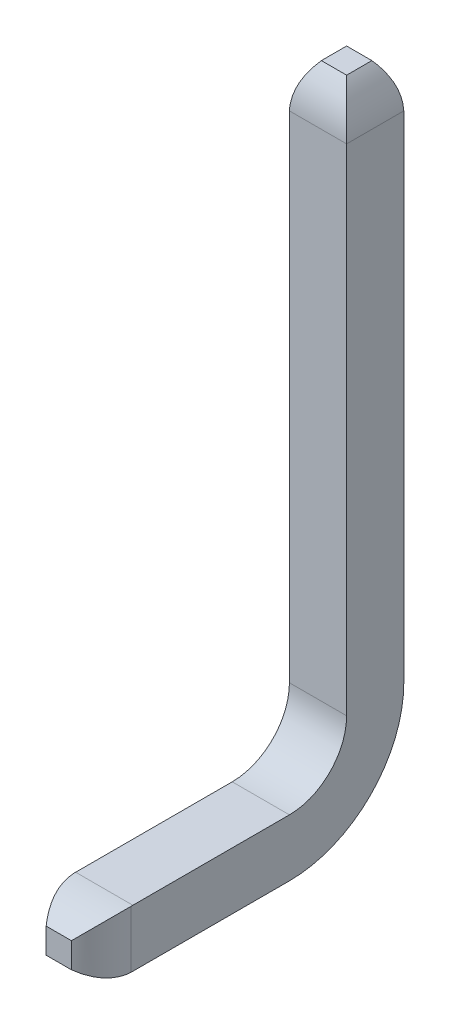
ISO-10303-21;
HEADER;
FILE_DESCRIPTION(('STEP AP214'),'2;1');
FILE_NAME('part.step','',(''),(''),'','','');
FILE_SCHEMA(('AUTOMOTIVE_DESIGN { 1 0 10303 214 1 1 1 1 }'));
ENDSEC;
DATA;
#1=APPLICATION_CONTEXT('core data for automotive mechanical design processes');
#2=APPLICATION_PROTOCOL_DEFINITION('international standard','automotive_design',2000,#1);
#3=PRODUCT_CONTEXT('',#1,'mechanical');
#4=PRODUCT('Part','Part','',(#3));
#5=PRODUCT_RELATED_PRODUCT_CATEGORY('part','',(#4));
#6=PRODUCT_DEFINITION_FORMATION('','',#4);
#7=PRODUCT_DEFINITION_CONTEXT('part definition',#1,'design');
#8=PRODUCT_DEFINITION('design','',#6,#7);
#9=PRODUCT_DEFINITION_SHAPE('','',#8);
#10=(LENGTH_UNIT() NAMED_UNIT(*) SI_UNIT(.MILLI.,.METRE.));
#11=(NAMED_UNIT(*) PLANE_ANGLE_UNIT() SI_UNIT($,.RADIAN.));
#12=(NAMED_UNIT(*) SI_UNIT($,.STERADIAN.) SOLID_ANGLE_UNIT());
#13=UNCERTAINTY_MEASURE_WITH_UNIT(LENGTH_MEASURE(1.E-05),#10,'distance_accuracy_value','');
#14=(GEOMETRIC_REPRESENTATION_CONTEXT(3) GLOBAL_UNCERTAINTY_ASSIGNED_CONTEXT((#13)) GLOBAL_UNIT_ASSIGNED_CONTEXT((#10,
#11,#12)) REPRESENTATION_CONTEXT('',''));
#15=CARTESIAN_POINT('',(0.,0.,0.));
#16=DIRECTION('',(0.,0.,1.));
#17=DIRECTION('',(1.,0.,0.));
#18=AXIS2_PLACEMENT_3D('',#15,#16,#17);
#19=CARTESIAN_POINT('',(0.384591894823,0.398742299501,2.12029800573));
#20=DIRECTION('',(0.,-1.,0.));
#21=DIRECTION('',(0.,0.,-1.));
#22=AXIS2_PLACEMENT_3D('',#19,#20,#21);
#23=CYLINDRICAL_SURFACE('',#22,0.635);
#24=CARTESIAN_POINT('',(-0.250190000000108,0.398531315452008,2.136939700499));
#25=CARTESIAN_POINT('',(-0.249812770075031,0.398160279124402,2.15140412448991));
#26=CARTESIAN_POINT('',(-0.248937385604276,0.397291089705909,2.16583284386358));
#27=CARTESIAN_POINT('',(-0.246222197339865,0.394588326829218,2.19449552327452));
#28=CARTESIAN_POINT('',(-0.244383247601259,0.392755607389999,2.20872964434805));
#29=CARTESIAN_POINT('',(-0.237513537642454,0.385904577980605,2.25070603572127));
#30=CARTESIAN_POINT('',(-0.231120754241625,0.379524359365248,2.27802199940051));
#31=CARTESIAN_POINT('',(-0.215201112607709,0.363630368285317,2.3306038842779));
#32=CARTESIAN_POINT('',(-0.205684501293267,0.354126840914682,2.35587617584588));
#33=CARTESIAN_POINT('',(-0.184043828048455,0.332513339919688,2.40416445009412));
#34=CARTESIAN_POINT('',(-0.171912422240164,0.320396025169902,2.4271738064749));
#35=CARTESIAN_POINT('',(-0.151298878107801,0.299805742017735,2.46125931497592));
#36=CARTESIAN_POINT('',(-0.143507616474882,0.29202314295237,2.47319261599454));
#37=CARTESIAN_POINT('',(-0.127388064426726,0.275921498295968,2.49619328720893));
#38=CARTESIAN_POINT('',(-0.119062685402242,0.267605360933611,2.50726472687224));
#39=CARTESIAN_POINT('',(-0.110489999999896,0.259042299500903,2.51793970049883));
#40=B_SPLINE_CURVE_WITH_KNOTS('',3,(#24,#25,#26,#27,#28,#29,#30,#31,#32,#33,#34,#35,#36,#37,#38,
#39),.UNSPECIFIED.,.F.,.F.,(4,2,2,2,2,2,2,4),(0.,0.0433870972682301,0.0867358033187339,
0.172547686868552,0.258080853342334,0.343857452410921,0.392536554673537,0.44096977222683),.UNSPECIFIED.);
#41=CARTESIAN_POINT('',(-0.250190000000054,0.398531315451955,2.13693970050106));
#42=VERTEX_POINT('',#41);
#43=CARTESIAN_POINT('',(-0.110489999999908,0.25904229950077,2.51793970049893));
#44=VERTEX_POINT('',#43);
#45=EDGE_CURVE('E122',#42,#44,#40,.T.);
#46=ORIENTED_EDGE('',*,*,#45,.F.);
#47=DIRECTION('',(0.,-1.,0.));
#48=VECTOR('',#47,1.);
#49=CARTESIAN_POINT('',(-0.250190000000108,0.398742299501,2.136939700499));
#50=LINE('',#49,#48);
#51=CARTESIAN_POINT('',(-0.250190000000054,-0.101426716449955,2.13693970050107));
#52=VERTEX_POINT('',#51);
#53=EDGE_CURVE('E125',#42,#52,#50,.T.);
#54=ORIENTED_EDGE('',*,*,#53,.T.);
#55=CARTESIAN_POINT('',(-0.110489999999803,0.038062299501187,2.51793970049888));
#56=CARTESIAN_POINT('',(-0.127635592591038,0.0209359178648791,2.49660889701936));
#57=CARTESIAN_POINT('',(-0.143837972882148,0.00475133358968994,2.47359119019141));
#58=CARTESIAN_POINT('',(-0.17378911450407,-0.0251659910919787,2.42407573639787));
#59=CARTESIAN_POINT('',(-0.187504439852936,-0.0388653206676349,2.39753784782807));
#60=CARTESIAN_POINT('',(-0.211535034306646,-0.0628649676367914,2.34120919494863));
#61=CARTESIAN_POINT('',(-0.221823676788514,-0.0731386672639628,2.31139524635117));
#62=CARTESIAN_POINT('',(-0.237911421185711,-0.0891972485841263,2.24960444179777));
#63=CARTESIAN_POINT('',(-0.243743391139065,-0.0950149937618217,2.21764534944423));
#64=CARTESIAN_POINT('',(-0.247902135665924,-0.099156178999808,2.17723767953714));
#65=CARTESIAN_POINT('',(-0.248573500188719,-0.0998240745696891,2.16920760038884));
#66=CARTESIAN_POINT('',(-0.249611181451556,-0.100854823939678,2.15310228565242));
#67=CARTESIAN_POINT('',(-0.24997727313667,-0.101217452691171,2.14502702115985));
#68=CARTESIAN_POINT('',(-0.250190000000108,-0.101426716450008,2.136939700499));
#69=B_SPLINE_CURVE_WITH_KNOTS('',3,(#55,#56,#57,#58,#59,#60,#61,#62,#63,#64,#65,#66,#67,#68),
.UNSPECIFIED.,.F.,.F.,(4,2,2,2,2,2,4),(0.,0.0969606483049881,0.195141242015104,
0.294067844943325,0.392257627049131,0.416507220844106,0.440774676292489),.UNSPECIFIED.);
#70=CARTESIAN_POINT('',(-0.110489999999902,0.038062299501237,2.51793970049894));
#71=VERTEX_POINT('',#70);
#72=EDGE_CURVE('E218',#71,#52,#69,.T.);
#73=ORIENTED_EDGE('',*,*,#72,.F.);
#74=DIRECTION('',(0.,-1.,0.));
#75=VECTOR('',#74,1.);
#76=CARTESIAN_POINT('',(-0.11049,0.398742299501,2.517939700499));
#77=LINE('',#76,#75);
#78=EDGE_CURVE('E134',#44,#71,#77,.T.);
#79=ORIENTED_EDGE('',*,*,#78,.F.);
#80=EDGE_LOOP('',(#46,#54,#73,#79));
#81=FACE_BOUND('',#80,.T.);
#82=ADVANCED_FACE('F17',(#81),#23,.T.);
#83=CARTESIAN_POINT('',(0.25019,0.398742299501,2.517939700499));
#84=DIRECTION('',(0.,0.,1.));
#85=DIRECTION('',(0.,-1.,0.));
#86=AXIS2_PLACEMENT_3D('',#83,#84,#85);
#87=PLANE('',#86);
#88=DIRECTION('',(1.,0.,0.));
#89=VECTOR('',#88,1.);
#90=CARTESIAN_POINT('',(-0.25019,0.259042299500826,2.51793970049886));
#91=LINE('',#90,#89);
#92=CARTESIAN_POINT('',(0.110489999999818,0.259042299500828,2.51793970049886));
#93=VERTEX_POINT('',#92);
#94=EDGE_CURVE('E137',#44,#93,#91,.T.);
#95=ORIENTED_EDGE('',*,*,#94,.F.);
#96=ORIENTED_EDGE('',*,*,#78,.T.);
#97=DIRECTION('',(1.,0.,0.));
#98=VECTOR('',#97,1.);
#99=CARTESIAN_POINT('',(-0.25019,0.0380622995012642,2.51793970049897));
#100=LINE('',#99,#98);
#101=CARTESIAN_POINT('',(0.110489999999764,0.0380622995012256,2.51793970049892));
#102=VERTEX_POINT('',#101);
#103=EDGE_CURVE('E215',#102,#71,#100,.F.);
#104=ORIENTED_EDGE('',*,*,#103,.F.);
#105=DIRECTION('',(0.,-1.,0.));
#106=VECTOR('',#105,1.);
#107=CARTESIAN_POINT('',(0.11048999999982,0.398742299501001,2.51793970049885));
#108=LINE('',#107,#106);
#109=EDGE_CURVE('E170',#93,#102,#108,.T.);
#110=ORIENTED_EDGE('',*,*,#109,.F.);
#111=EDGE_LOOP('',(#95,#96,#104,#110));
#112=FACE_BOUND('',#111,.T.);
#113=ADVANCED_FACE('F324',(#112),#87,.T.);
#114=CARTESIAN_POINT('',(-0.25019,0.533362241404,2.120569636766));
#115=DIRECTION('',(1.,0.,0.));
#116=DIRECTION('',(0.,0.,-1.));
#117=AXIS2_PLACEMENT_3D('',#114,#115,#116);
#118=CYLINDRICAL_SURFACE('',#117,0.635);
#119=CARTESIAN_POINT('',(-0.25019,0.533362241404,2.120569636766));
#120=DIRECTION('',(1.,0.,0.));
#121=DIRECTION('',(0.,0.,-1.));
#122=AXIS2_PLACEMENT_3D('',#119,#120,#121);
#123=CIRCLE('',#122,0.635);
#124=CARTESIAN_POINT('',(-0.25019,-0.101637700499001,2.120569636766));
#125=VERTEX_POINT('',#124);
#126=EDGE_CURVE('E130',#52,#125,#123,.T.);
#127=ORIENTED_EDGE('',*,*,#126,.T.);
#128=DIRECTION('',(1.,0.,0.));
#129=VECTOR('',#128,1.);
#130=CARTESIAN_POINT('',(-0.25019,-0.101637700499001,2.120569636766));
#131=LINE('',#130,#129);
#132=CARTESIAN_POINT('',(0.250190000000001,-0.101637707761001,2.120569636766));
#133=VERTEX_POINT('',#132);
#134=EDGE_CURVE('E211',#133,#125,#131,.F.);
#135=ORIENTED_EDGE('',*,*,#134,.F.);
#136=CARTESIAN_POINT('',(0.250190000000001,0.533362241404,2.120569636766));
#137=DIRECTION('',(1.,0.,0.));
#138=DIRECTION('',(0.,0.,-1.));
#139=AXIS2_PLACEMENT_3D('',#136,#137,#138);
#140=CIRCLE('',#139,0.635);
#141=CARTESIAN_POINT('',(0.250190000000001,-0.101426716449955,2.13693970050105));
#142=VERTEX_POINT('',#141);
#143=EDGE_CURVE('E171',#142,#133,#140,.T.);
#144=ORIENTED_EDGE('',*,*,#143,.F.);
#145=CARTESIAN_POINT('',(0.110489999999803,0.0380622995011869,2.51793970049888));
#146=CARTESIAN_POINT('',(0.127635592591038,0.0209359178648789,2.49660889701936));
#147=CARTESIAN_POINT('',(0.143837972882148,0.00475133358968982,2.47359119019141));
#148=CARTESIAN_POINT('',(0.17378911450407,-0.0251659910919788,2.42407573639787));
#149=CARTESIAN_POINT('',(0.187504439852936,-0.038865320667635,2.39753784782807));
#150=CARTESIAN_POINT('',(0.211535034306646,-0.0628649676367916,2.34120919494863));
#151=CARTESIAN_POINT('',(0.221823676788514,-0.0731386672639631,2.31139524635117));
#152=CARTESIAN_POINT('',(0.237911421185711,-0.0891972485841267,2.24960444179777));
#153=CARTESIAN_POINT('',(0.243743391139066,-0.0950149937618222,2.21764534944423));
#154=CARTESIAN_POINT('',(0.247902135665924,-0.0991561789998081,2.17723767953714));
#155=CARTESIAN_POINT('',(0.24857350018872,-0.0998240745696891,2.16920760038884));
#156=CARTESIAN_POINT('',(0.249611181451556,-0.100854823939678,2.15310228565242));
#157=CARTESIAN_POINT('',(0.24997727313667,-0.101217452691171,2.14502702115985));
#158=CARTESIAN_POINT('',(0.250190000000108,-0.101426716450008,2.136939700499));
#159=B_SPLINE_CURVE_WITH_KNOTS('',3,(#145,#146,#147,#148,#149,#150,#151,#152,#153,#154,#155,
#156,#157,#158),.UNSPECIFIED.,.F.,.F.,(4,2,2,2,2,2,4),(0.,0.0969606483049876,0.195141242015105,
0.294067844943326,0.392257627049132,0.416507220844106,0.440774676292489),.UNSPECIFIED.);
#160=EDGE_CURVE('E139',#102,#142,#159,.T.);
#161=ORIENTED_EDGE('',*,*,#160,.F.);
#162=ORIENTED_EDGE('',*,*,#103,.T.);
#163=ORIENTED_EDGE('',*,*,#72,.T.);
#164=EDGE_LOOP('',(#127,#135,#144,#161,#162,#163));
#165=FACE_BOUND('',#164,.T.);
#166=ADVANCED_FACE('F316',(#165),#118,.T.);
#167=CARTESIAN_POINT('',(-0.25019,-0.101637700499,2.517939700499));
#168=DIRECTION('',(0.,-1.,0.));
#169=DIRECTION('',(0.,0.,-1.));
#170=AXIS2_PLACEMENT_3D('',#167,#168,#169);
#171=PLANE('',#170);
#172=DIRECTION('',(0.,0.,-1.));
#173=VECTOR('',#172,1.);
#174=CARTESIAN_POINT('',(-0.25019,-0.101637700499,2.517939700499));
#175=LINE('',#174,#173);
#176=CARTESIAN_POINT('',(-0.25019,-0.101637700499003,0.750570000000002));
#177=VERTEX_POINT('',#176);
#178=EDGE_CURVE('E207',#125,#177,#175,.T.);
#179=ORIENTED_EDGE('',*,*,#178,.T.);
#180=DIRECTION('',(1.,0.,0.));
#181=VECTOR('',#180,1.);
#182=CARTESIAN_POINT('',(-0.25019,-0.101637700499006,0.75057));
#183=LINE('',#182,#181);
#184=CARTESIAN_POINT('',(0.250190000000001,-0.101637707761,0.75057));
#185=VERTEX_POINT('',#184);
#186=EDGE_CURVE('E210',#177,#185,#183,.T.);
#187=ORIENTED_EDGE('',*,*,#186,.T.);
#188=DIRECTION('',(0.,0.,-1.));
#189=VECTOR('',#188,1.);
#190=CARTESIAN_POINT('',(0.25019,-0.101637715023,-5.142700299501));
#191=LINE('',#190,#189);
#192=EDGE_CURVE('E174',#133,#185,#191,.T.);
#193=ORIENTED_EDGE('',*,*,#192,.F.);
#194=ORIENTED_EDGE('',*,*,#134,.T.);
#195=EDGE_LOOP('',(#179,#187,#193,#194));
#196=FACE_BOUND('',#195,.T.);
#197=ADVANCED_FACE('F313',(#196),#171,.T.);
#198=CARTESIAN_POINT('',(-0.25019,0.398742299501,2.517939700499));
#199=DIRECTION('',(0.,-1.,0.));
#200=DIRECTION('',(0.,0.,-1.));
#201=AXIS2_PLACEMENT_3D('',#198,#199,#200);
#202=PLANE('',#201);
#203=DIRECTION('',(1.,0.,0.));
#204=VECTOR('',#203,1.);
#205=CARTESIAN_POINT('',(-0.25019,0.398742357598,2.120569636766));
#206=LINE('',#205,#204);
#207=CARTESIAN_POINT('',(0.250190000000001,0.3987423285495,2.120569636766));
#208=VERTEX_POINT('',#207);
#209=CARTESIAN_POINT('',(-0.25019,0.398742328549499,2.120569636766));
#210=VERTEX_POINT('',#209);
#211=EDGE_CURVE('E124',#208,#210,#206,.F.);
#212=ORIENTED_EDGE('',*,*,#211,.F.);
#213=DIRECTION('',(0.,0.,-1.));
#214=VECTOR('',#213,1.);
#215=CARTESIAN_POINT('',(0.25019,0.398742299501,-5.142700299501));
#216=LINE('',#215,#214);
#217=CARTESIAN_POINT('',(0.25019,0.398742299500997,0.75057));
#218=VERTEX_POINT('',#217);
#219=EDGE_CURVE('E179',#218,#208,#216,.F.);
#220=ORIENTED_EDGE('',*,*,#219,.F.);
#221=DIRECTION('',(1.,0.,0.));
#222=VECTOR('',#221,1.);
#223=CARTESIAN_POINT('',(-0.25019,0.398742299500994,0.75057));
#224=LINE('',#223,#222);
#225=CARTESIAN_POINT('',(-0.25019,0.398742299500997,0.750570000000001));
#226=VERTEX_POINT('',#225);
#227=EDGE_CURVE('E212',#226,#218,#224,.T.);
#228=ORIENTED_EDGE('',*,*,#227,.F.);
#229=DIRECTION('',(0.,0.,-1.));
#230=VECTOR('',#229,1.);
#231=CARTESIAN_POINT('',(-0.25019,0.398742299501,2.517939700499));
#232=LINE('',#231,#230);
#233=EDGE_CURVE('E141',#210,#226,#232,.T.);
#234=ORIENTED_EDGE('',*,*,#233,.F.);
#235=EDGE_LOOP('',(#212,#220,#228,#234));
#236=FACE_BOUND('',#235,.T.);
#237=ADVANCED_FACE('F159',(#236),#202,.F.);
#238=CARTESIAN_POINT('',(-0.25019,-0.236257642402,2.120569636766));
#239=DIRECTION('',(1.,0.,0.));
#240=DIRECTION('',(0.,0.,-1.));
#241=AXIS2_PLACEMENT_3D('',#238,#239,#240);
#242=CYLINDRICAL_SURFACE('',#241,0.635);
#243=CARTESIAN_POINT('',(0.250190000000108,0.398531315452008,2.136939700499));
#244=CARTESIAN_POINT('',(0.249812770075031,0.398160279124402,2.15140412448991));
#245=CARTESIAN_POINT('',(0.248937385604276,0.397291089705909,2.16583284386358));
#246=CARTESIAN_POINT('',(0.246222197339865,0.394588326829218,2.19449552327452));
#247=CARTESIAN_POINT('',(0.244383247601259,0.392755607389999,2.20872964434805));
#248=CARTESIAN_POINT('',(0.237513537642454,0.385904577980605,2.25070603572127));
#249=CARTESIAN_POINT('',(0.231120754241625,0.379524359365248,2.27802199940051));
#250=CARTESIAN_POINT('',(0.215201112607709,0.363630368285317,2.3306038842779));
#251=CARTESIAN_POINT('',(0.205684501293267,0.354126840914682,2.35587617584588));
#252=CARTESIAN_POINT('',(0.184043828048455,0.332513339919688,2.40416445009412));
#253=CARTESIAN_POINT('',(0.171912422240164,0.320396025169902,2.4271738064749));
#254=CARTESIAN_POINT('',(0.151298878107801,0.299805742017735,2.46125931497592));
#255=CARTESIAN_POINT('',(0.143507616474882,0.29202314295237,2.47319261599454));
#256=CARTESIAN_POINT('',(0.127388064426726,0.275921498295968,2.49619328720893));
#257=CARTESIAN_POINT('',(0.119062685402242,0.267605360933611,2.50726472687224));
#258=CARTESIAN_POINT('',(0.110489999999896,0.259042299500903,2.51793970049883));
#259=B_SPLINE_CURVE_WITH_KNOTS('',3,(#243,#244,#245,#246,#247,#248,#249,#250,#251,#252,#253,
#254,#255,#256,#257,#258),.UNSPECIFIED.,.F.,.F.,(4,2,2,2,2,2,2,4),(0.,0.0433870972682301,
0.0867358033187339,0.172547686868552,0.258080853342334,0.343857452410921,0.392536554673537,
0.44096977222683),.UNSPECIFIED.);
#260=CARTESIAN_POINT('',(0.250190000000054,0.398531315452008,2.136939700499));
#261=VERTEX_POINT('',#260);
#262=EDGE_CURVE('E164',#261,#93,#259,.T.);
#263=ORIENTED_EDGE('',*,*,#262,.F.);
#264=CARTESIAN_POINT('',(0.250190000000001,-0.236257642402,2.120569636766));
#265=DIRECTION('',(1.,0.,0.));
#266=DIRECTION('',(0.,0.,-1.));
#267=AXIS2_PLACEMENT_3D('',#264,#265,#266);
#268=CIRCLE('',#267,0.635);
#269=EDGE_CURVE('E175',#208,#261,#268,.T.);
#270=ORIENTED_EDGE('',*,*,#269,.F.);
#271=ORIENTED_EDGE('',*,*,#211,.T.);
#272=CARTESIAN_POINT('',(-0.25019,-0.236257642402,2.120569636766));
#273=DIRECTION('',(1.,0.,0.));
#274=DIRECTION('',(0.,0.,-1.));
#275=AXIS2_PLACEMENT_3D('',#272,#273,#274);
#276=CIRCLE('',#275,0.635);
#277=EDGE_CURVE('E21',#210,#42,#276,.T.);
#278=ORIENTED_EDGE('',*,*,#277,.T.);
#279=ORIENTED_EDGE('',*,*,#45,.T.);
#280=ORIENTED_EDGE('',*,*,#94,.T.);
#281=EDGE_LOOP('',(#263,#270,#271,#278,#279,#280));
#282=FACE_BOUND('',#281,.T.);
#283=ADVANCED_FACE('F120',(#282),#242,.T.);
#284=CARTESIAN_POINT('',(-0.384591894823,0.398742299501,2.12029800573));
#285=DIRECTION('',(0.,-1.,0.));
#286=DIRECTION('',(0.,0.,-1.));
#287=AXIS2_PLACEMENT_3D('',#284,#285,#286);
#288=CYLINDRICAL_SURFACE('',#287,0.635);
#289=ORIENTED_EDGE('',*,*,#262,.T.);
#290=ORIENTED_EDGE('',*,*,#109,.T.);
#291=ORIENTED_EDGE('',*,*,#160,.T.);
#292=DIRECTION('',(0.,1.,0.));
#293=VECTOR('',#292,1.);
#294=CARTESIAN_POINT('',(0.250190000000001,0.398742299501,2.136939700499));
#295=LINE('',#294,#293);
#296=EDGE_CURVE('E178',#261,#142,#295,.F.);
#297=ORIENTED_EDGE('',*,*,#296,.F.);
#298=EDGE_LOOP('',(#289,#290,#291,#297));
#299=FACE_BOUND('',#298,.T.);
#300=ADVANCED_FACE('F158',(#299),#288,.T.);
#301=CARTESIAN_POINT('',(-7.943444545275,0.899122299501,0.75057));
#302=DIRECTION('',(1.,0.,0.));
#303=DIRECTION('',(0.,0.,-1.));
#304=AXIS2_PLACEMENT_3D('',#301,#302,#303);
#305=CYLINDRICAL_SURFACE('',#304,1.00076);
#306=ORIENTED_EDGE('',*,*,#186,.F.);
#307=CARTESIAN_POINT('',(-0.25019,0.899122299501,0.75057));
#308=DIRECTION('',(1.,0.,0.));
#309=DIRECTION('',(0.,0.,-1.));
#310=AXIS2_PLACEMENT_3D('',#307,#308,#309);
#311=CIRCLE('',#310,1.00076);
#312=CARTESIAN_POINT('',(-0.25019,0.899122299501,-0.25019));
#313=VERTEX_POINT('',#312);
#314=EDGE_CURVE('E183',#177,#313,#311,.T.);
#315=ORIENTED_EDGE('',*,*,#314,.T.);
#316=DIRECTION('',(1.,0.,0.));
#317=VECTOR('',#316,1.);
#318=CARTESIAN_POINT('',(-7.943444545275,0.899122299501,-0.25019));
#319=LINE('',#318,#317);
#320=CARTESIAN_POINT('',(0.25019,0.899122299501,-0.25019));
#321=VERTEX_POINT('',#320);
#322=EDGE_CURVE('E184',#313,#321,#319,.T.);
#323=ORIENTED_EDGE('',*,*,#322,.T.);
#324=CARTESIAN_POINT('',(0.250190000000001,0.899122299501,0.75057));
#325=DIRECTION('',(1.,0.,0.));
#326=DIRECTION('',(0.,0.,-1.));
#327=AXIS2_PLACEMENT_3D('',#324,#325,#326);
#328=CIRCLE('',#327,1.00076);
#329=EDGE_CURVE('E180',#185,#321,#328,.T.);
#330=ORIENTED_EDGE('',*,*,#329,.F.);
#331=EDGE_LOOP('',(#306,#315,#323,#330));
#332=FACE_BOUND('',#331,.T.);
#333=ADVANCED_FACE('F370',(#332),#305,.T.);
#334=CARTESIAN_POINT('',(-7.943444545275,0.899122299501,0.75057));
#335=DIRECTION('',(1.,0.,0.));
#336=DIRECTION('',(0.,0.,-1.));
#337=AXIS2_PLACEMENT_3D('',#334,#335,#336);
#338=CYLINDRICAL_SURFACE('',#337,0.50038);
#339=ORIENTED_EDGE('',*,*,#227,.T.);
#340=CARTESIAN_POINT('',(0.250190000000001,0.899122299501,0.75057));
#341=DIRECTION('',(1.,0.,0.));
#342=DIRECTION('',(0.,0.,-1.));
#343=AXIS2_PLACEMENT_3D('',#340,#341,#342);
#344=CIRCLE('',#343,0.50038);
#345=CARTESIAN_POINT('',(0.25019,0.899122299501,0.25019));
#346=VERTEX_POINT('',#345);
#347=EDGE_CURVE('E187',#346,#218,#344,.F.);
#348=ORIENTED_EDGE('',*,*,#347,.F.);
#349=DIRECTION('',(-1.,0.,0.));
#350=VECTOR('',#349,1.);
#351=CARTESIAN_POINT('',(-0.25019,0.899122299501,0.25019));
#352=LINE('',#351,#350);
#353=CARTESIAN_POINT('',(-0.25019,0.899122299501,0.25019));
#354=VERTEX_POINT('',#353);
#355=EDGE_CURVE('E200',#346,#354,#352,.T.);
#356=ORIENTED_EDGE('',*,*,#355,.T.);
#357=CARTESIAN_POINT('',(-0.25019,0.899122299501,0.75057));
#358=DIRECTION('',(1.,0.,0.));
#359=DIRECTION('',(0.,0.,-1.));
#360=AXIS2_PLACEMENT_3D('',#357,#358,#359);
#361=CIRCLE('',#360,0.50038);
#362=EDGE_CURVE('E190',#226,#354,#361,.T.);
#363=ORIENTED_EDGE('',*,*,#362,.F.);
#364=EDGE_LOOP('',(#339,#348,#356,#363));
#365=FACE_BOUND('',#364,.T.);
#366=ADVANCED_FACE('F308',(#365),#338,.F.);
#367=CARTESIAN_POINT('',(-0.25019,5.215758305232,-0.384591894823));
#368=DIRECTION('',(1.,0.,0.));
#369=DIRECTION('',(0.,0.,-1.));
#370=AXIS2_PLACEMENT_3D('',#367,#368,#369);
#371=CYLINDRICAL_SURFACE('',#370,0.635);
#372=DIRECTION('',(1.,0.,0.));
#373=VECTOR('',#372,1.);
#374=CARTESIAN_POINT('',(-0.25019,5.6134,0.11049));
#375=LINE('',#374,#373);
#376=CARTESIAN_POINT('',(-0.110490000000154,5.61340000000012,0.110490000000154));
#377=VERTEX_POINT('',#376);
#378=CARTESIAN_POINT('',(0.110490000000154,5.61340000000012,0.110490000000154));
#379=VERTEX_POINT('',#378);
#380=EDGE_CURVE('E192',#377,#379,#375,.T.);
#381=ORIENTED_EDGE('',*,*,#380,.F.);
#382=CARTESIAN_POINT('',(0.384591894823,5.215758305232,-0.384591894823));
#383=DIRECTION('',(0.707106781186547,0.,0.707106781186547));
#384=DIRECTION('',(-0.707106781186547,0.,0.707106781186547));
#385=AXIS2_PLACEMENT_3D('',#382,#383,#384);
#386=ELLIPSE('',#385,0.898025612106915,0.635);
#387=CARTESIAN_POINT('',(-0.25019,5.23240000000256,0.25019));
#388=VERTEX_POINT('',#387);
#389=EDGE_CURVE('E197',#388,#377,#386,.F.);
#390=ORIENTED_EDGE('',*,*,#389,.F.);
#391=DIRECTION('',(-1.,0.,0.));
#392=VECTOR('',#391,1.);
#393=CARTESIAN_POINT('',(-0.25019,5.2324,0.25019));
#394=LINE('',#393,#392);
#395=CARTESIAN_POINT('',(0.25019,5.23240000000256,0.25019));
#396=VERTEX_POINT('',#395);
#397=EDGE_CURVE('E234',#388,#396,#394,.F.);
#398=ORIENTED_EDGE('',*,*,#397,.T.);
#399=CARTESIAN_POINT('',(-0.384591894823,5.215758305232,-0.384591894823));
#400=DIRECTION('',(-0.707106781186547,0.,0.707106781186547));
#401=DIRECTION('',(0.707106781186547,0.,0.707106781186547));
#402=AXIS2_PLACEMENT_3D('',#399,#400,#401);
#403=ELLIPSE('',#402,0.898025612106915,0.635);
#404=EDGE_CURVE('E193',#379,#396,#403,.F.);
#405=ORIENTED_EDGE('',*,*,#404,.F.);
#406=EDGE_LOOP('',(#381,#390,#398,#405));
#407=FACE_BOUND('',#406,.T.);
#408=ADVANCED_FACE('F270',(#407),#371,.T.);
#409=CARTESIAN_POINT('',(-0.25019,5.6134,0.25019));
#410=DIRECTION('',(0.,1.,0.));
#411=DIRECTION('',(0.,0.,1.));
#412=AXIS2_PLACEMENT_3D('',#409,#410,#411);
#413=PLANE('',#412);
#414=ORIENTED_EDGE('',*,*,#380,.T.);
#415=DIRECTION('',(0.,0.,1.));
#416=VECTOR('',#415,1.);
#417=CARTESIAN_POINT('',(0.110490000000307,5.61340000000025,-0.25019));
#418=LINE('',#417,#416);
#419=CARTESIAN_POINT('',(0.110490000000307,5.61340000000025,-0.110490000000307));
#420=VERTEX_POINT('',#419);
#421=EDGE_CURVE('E196',#420,#379,#418,.T.);
#422=ORIENTED_EDGE('',*,*,#421,.F.);
#423=DIRECTION('',(1.,0.,0.));
#424=VECTOR('',#423,1.);
#425=CARTESIAN_POINT('',(-0.25019,5.61340000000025,-0.110490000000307));
#426=LINE('',#425,#424);
#427=CARTESIAN_POINT('',(-0.110490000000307,5.61340000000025,-0.110490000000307));
#428=VERTEX_POINT('',#427);
#429=EDGE_CURVE('E204',#428,#420,#426,.T.);
#430=ORIENTED_EDGE('',*,*,#429,.F.);
#431=DIRECTION('',(0.,0.,1.));
#432=VECTOR('',#431,1.);
#433=CARTESIAN_POINT('',(-0.110490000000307,5.61340000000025,-0.25019));
#434=LINE('',#433,#432);
#435=EDGE_CURVE('E195',#377,#428,#434,.F.);
#436=ORIENTED_EDGE('',*,*,#435,.F.);
#437=EDGE_LOOP('',(#414,#422,#430,#436));
#438=FACE_BOUND('',#437,.T.);
#439=ADVANCED_FACE('F265',(#438),#413,.T.);
#440=CARTESIAN_POINT('',(-0.384591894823,5.215758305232,-0.25019));
#441=DIRECTION('',(0.,0.,1.));
#442=DIRECTION('',(1.,0.,0.));
#443=AXIS2_PLACEMENT_3D('',#440,#441,#442);
#444=CYLINDRICAL_SURFACE('',#443,0.635);
#445=ORIENTED_EDGE('',*,*,#421,.T.);
#446=ORIENTED_EDGE('',*,*,#404,.T.);
#447=DIRECTION('',(0.,0.,1.));
#448=VECTOR('',#447,1.);
#449=CARTESIAN_POINT('',(0.25019,5.2324,0.25019));
#450=LINE('',#449,#448);
#451=CARTESIAN_POINT('',(0.25019,5.23240000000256,-0.25019));
#452=VERTEX_POINT('',#451);
#453=EDGE_CURVE('E36',#452,#396,#450,.T.);
#454=ORIENTED_EDGE('',*,*,#453,.F.);
#455=CARTESIAN_POINT('',(-0.384591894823,5.215758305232,0.384591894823));
#456=DIRECTION('',(0.707106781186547,0.,0.707106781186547));
#457=DIRECTION('',(0.707106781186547,0.,-0.707106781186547));
#458=AXIS2_PLACEMENT_3D('',#455,#456,#457);
#459=ELLIPSE('',#458,0.898025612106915,0.635);
#460=EDGE_CURVE('E201',#420,#452,#459,.F.);
#461=ORIENTED_EDGE('',*,*,#460,.F.);
#462=EDGE_LOOP('',(#445,#446,#454,#461));
#463=FACE_BOUND('',#462,.T.);
#464=ADVANCED_FACE('F273',(#463),#444,.T.);
#465=CARTESIAN_POINT('',(0.384591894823,5.215758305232,-0.25019));
#466=DIRECTION('',(0.,0.,1.));
#467=DIRECTION('',(1.,0.,0.));
#468=AXIS2_PLACEMENT_3D('',#465,#466,#467);
#469=CYLINDRICAL_SURFACE('',#468,0.635);
#470=DIRECTION('',(0.,0.,1.));
#471=VECTOR('',#470,1.);
#472=CARTESIAN_POINT('',(-0.25019,5.2324,0.25019));
#473=LINE('',#472,#471);
#474=CARTESIAN_POINT('',(-0.25019,5.23240000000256,-0.25019));
#475=VERTEX_POINT('',#474);
#476=EDGE_CURVE('E239',#475,#388,#473,.T.);
#477=ORIENTED_EDGE('',*,*,#476,.T.);
#478=ORIENTED_EDGE('',*,*,#389,.T.);
#479=ORIENTED_EDGE('',*,*,#435,.T.);
#480=CARTESIAN_POINT('',(0.384591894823,5.215758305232,0.384591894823));
#481=DIRECTION('',(0.707106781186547,0.,-0.707106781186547));
#482=DIRECTION('',(0.707106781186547,0.,0.707106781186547));
#483=AXIS2_PLACEMENT_3D('',#480,#481,#482);
#484=ELLIPSE('',#483,0.898025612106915,0.635);
#485=EDGE_CURVE('E203',#475,#428,#484,.T.);
#486=ORIENTED_EDGE('',*,*,#485,.F.);
#487=EDGE_LOOP('',(#477,#478,#479,#486));
#488=FACE_BOUND('',#487,.T.);
#489=ADVANCED_FACE('F267',(#488),#469,.T.);
#490=CARTESIAN_POINT('',(-0.25019,-2.04724,0.25019));
#491=DIRECTION('',(0.,0.,-1.));
#492=DIRECTION('',(-1.,0.,0.));
#493=AXIS2_PLACEMENT_3D('',#490,#491,#492);
#494=PLANE('',#493);
#495=ORIENTED_EDGE('',*,*,#397,.F.);
#496=DIRECTION('',(0.,1.,0.));
#497=VECTOR('',#496,1.);
#498=CARTESIAN_POINT('',(-0.25019,5.6134,0.25019));
#499=LINE('',#498,#497);
#500=EDGE_CURVE('E242',#388,#354,#499,.F.);
#501=ORIENTED_EDGE('',*,*,#500,.T.);
#502=ORIENTED_EDGE('',*,*,#355,.F.);
#503=DIRECTION('',(0.,1.,0.));
#504=VECTOR('',#503,1.);
#505=CARTESIAN_POINT('',(0.25019,5.6134,0.25019));
#506=LINE('',#505,#504);
#507=EDGE_CURVE('E236',#396,#346,#506,.F.);
#508=ORIENTED_EDGE('',*,*,#507,.F.);
#509=EDGE_LOOP('',(#495,#501,#502,#508));
#510=FACE_BOUND('',#509,.T.);
#511=ADVANCED_FACE('F281',(#510),#494,.F.);
#512=CARTESIAN_POINT('',(-0.25019,5.215758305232,0.384591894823));
#513=DIRECTION('',(1.,0.,0.));
#514=DIRECTION('',(0.,0.,-1.));
#515=AXIS2_PLACEMENT_3D('',#512,#513,#514);
#516=CYLINDRICAL_SURFACE('',#515,0.635);
#517=DIRECTION('',(-1.,0.,0.));
#518=VECTOR('',#517,1.);
#519=CARTESIAN_POINT('',(-0.25019,5.2324,-0.25019));
#520=LINE('',#519,#518);
#521=EDGE_CURVE('E245',#475,#452,#520,.F.);
#522=ORIENTED_EDGE('',*,*,#521,.F.);
#523=ORIENTED_EDGE('',*,*,#485,.T.);
#524=ORIENTED_EDGE('',*,*,#429,.T.);
#525=ORIENTED_EDGE('',*,*,#460,.T.);
#526=EDGE_LOOP('',(#522,#523,#524,#525));
#527=FACE_BOUND('',#526,.T.);
#528=ADVANCED_FACE('F260',(#527),#516,.T.);
#529=CARTESIAN_POINT('',(0.25019,5.6134,0.25019));
#530=DIRECTION('',(1.,0.,0.));
#531=DIRECTION('',(0.,1.,0.));
#532=AXIS2_PLACEMENT_3D('',#529,#530,#531);
#533=PLANE('',#532);
#534=ORIENTED_EDGE('',*,*,#507,.T.);
#535=ORIENTED_EDGE('',*,*,#347,.T.);
#536=ORIENTED_EDGE('',*,*,#219,.T.);
#537=ORIENTED_EDGE('',*,*,#269,.T.);
#538=ORIENTED_EDGE('',*,*,#296,.T.);
#539=ORIENTED_EDGE('',*,*,#143,.T.);
#540=ORIENTED_EDGE('',*,*,#192,.T.);
#541=ORIENTED_EDGE('',*,*,#329,.T.);
#542=DIRECTION('',(0.,1.,0.));
#543=VECTOR('',#542,1.);
#544=CARTESIAN_POINT('',(0.25019,-2.04724,-0.25019));
#545=LINE('',#544,#543);
#546=EDGE_CURVE('E27',#452,#321,#545,.F.);
#547=ORIENTED_EDGE('',*,*,#546,.F.);
#548=ORIENTED_EDGE('',*,*,#453,.T.);
#549=EDGE_LOOP('',(#534,#535,#536,#537,#538,#539,#540,#541,#547,#548));
#550=FACE_BOUND('',#549,.T.);
#551=ADVANCED_FACE('F291',(#550),#533,.T.);
#552=CARTESIAN_POINT('',(-0.25019,5.6134,0.25019));
#553=DIRECTION('',(1.,0.,0.));
#554=DIRECTION('',(0.,1.,0.));
#555=AXIS2_PLACEMENT_3D('',#552,#553,#554);
#556=PLANE('',#555);
#557=ORIENTED_EDGE('',*,*,#476,.F.);
#558=DIRECTION('',(0.,1.,0.));
#559=VECTOR('',#558,1.);
#560=CARTESIAN_POINT('',(-0.25019,-2.04724,-0.25019));
#561=LINE('',#560,#559);
#562=EDGE_CURVE('E11',#313,#475,#561,.T.);
#563=ORIENTED_EDGE('',*,*,#562,.F.);
#564=ORIENTED_EDGE('',*,*,#314,.F.);
#565=ORIENTED_EDGE('',*,*,#178,.F.);
#566=ORIENTED_EDGE('',*,*,#126,.F.);
#567=ORIENTED_EDGE('',*,*,#53,.F.);
#568=ORIENTED_EDGE('',*,*,#277,.F.);
#569=ORIENTED_EDGE('',*,*,#233,.T.);
#570=ORIENTED_EDGE('',*,*,#362,.T.);
#571=ORIENTED_EDGE('',*,*,#500,.F.);
#572=EDGE_LOOP('',(#557,#563,#564,#565,#566,#567,#568,#569,#570,#571));
#573=FACE_BOUND('',#572,.T.);
#574=ADVANCED_FACE('F128',(#573),#556,.F.);
#575=CARTESIAN_POINT('',(-0.25019,-2.04724,-0.25019));
#576=DIRECTION('',(0.,0.,-1.));
#577=DIRECTION('',(-1.,0.,0.));
#578=AXIS2_PLACEMENT_3D('',#575,#576,#577);
#579=PLANE('',#578);
#580=ORIENTED_EDGE('',*,*,#322,.F.);
#581=ORIENTED_EDGE('',*,*,#562,.T.);
#582=ORIENTED_EDGE('',*,*,#521,.T.);
#583=ORIENTED_EDGE('',*,*,#546,.T.);
#584=EDGE_LOOP('',(#580,#581,#582,#583));
#585=FACE_BOUND('',#584,.T.);
#586=ADVANCED_FACE('F284',(#585),#579,.T.);
#587=CLOSED_SHELL('',(#82,#113,#166,#197,#237,#283,#300,#333,#366,#408,#439,#464,#489,#511,#528,
#551,#574,#586));
#588=MANIFOLD_SOLID_BREP('B1',#587);
#589=ADVANCED_BREP_SHAPE_REPRESENTATION('',(#18,#588),#14);
#590=SHAPE_DEFINITION_REPRESENTATION(#9,#589);
ENDSEC;
END-ISO-10303-21;
